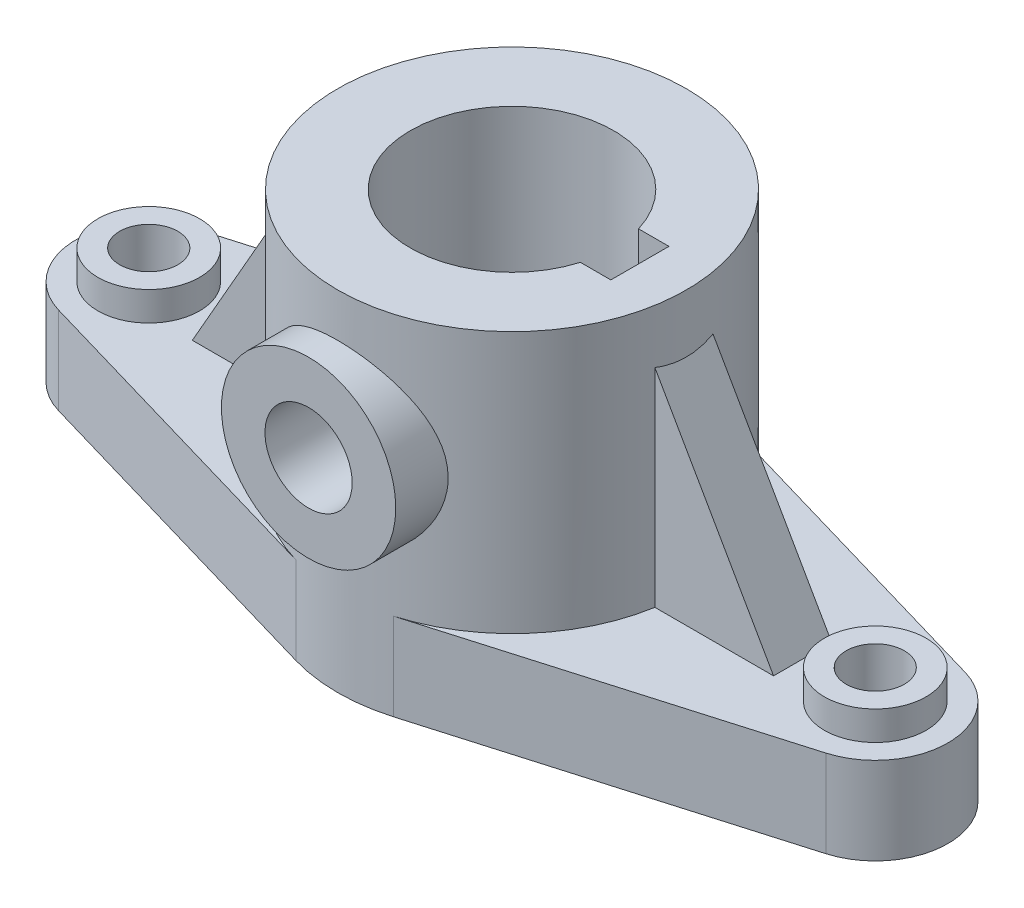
ISO-10303-21;
HEADER;
FILE_DESCRIPTION(('STEP AP214'),'2;1');
FILE_NAME('part.step','',(''),(''),'','','');
FILE_SCHEMA(('AUTOMOTIVE_DESIGN { 1 0 10303 214 1 1 1 1 }'));
ENDSEC;
DATA;
#1=APPLICATION_CONTEXT('core data for automotive mechanical design processes');
#2=APPLICATION_PROTOCOL_DEFINITION('international standard','automotive_design',2000,#1);
#3=PRODUCT_CONTEXT('',#1,'mechanical');
#4=PRODUCT('Part','Part','',(#3));
#5=PRODUCT_RELATED_PRODUCT_CATEGORY('part','',(#4));
#6=PRODUCT_DEFINITION_FORMATION('','',#4);
#7=PRODUCT_DEFINITION_CONTEXT('part definition',#1,'design');
#8=PRODUCT_DEFINITION('design','',#6,#7);
#9=PRODUCT_DEFINITION_SHAPE('','',#8);
#10=(LENGTH_UNIT() NAMED_UNIT(*) SI_UNIT(.MILLI.,.METRE.));
#11=(NAMED_UNIT(*) PLANE_ANGLE_UNIT() SI_UNIT($,.RADIAN.));
#12=(NAMED_UNIT(*) SI_UNIT($,.STERADIAN.) SOLID_ANGLE_UNIT());
#13=UNCERTAINTY_MEASURE_WITH_UNIT(LENGTH_MEASURE(1.E-05),#10,'distance_accuracy_value','');
#14=(GEOMETRIC_REPRESENTATION_CONTEXT(3) GLOBAL_UNCERTAINTY_ASSIGNED_CONTEXT((#13)) GLOBAL_UNIT_ASSIGNED_CONTEXT((#10,
#11,#12)) REPRESENTATION_CONTEXT('',''));
#15=CARTESIAN_POINT('',(0.,0.,0.));
#16=DIRECTION('',(0.,0.,1.));
#17=DIRECTION('',(1.,0.,0.));
#18=AXIS2_PLACEMENT_3D('',#15,#16,#17);
#19=CARTESIAN_POINT('',(0.,6.,0.));
#20=DIRECTION('',(0.,1.,0.));
#21=DIRECTION('',(0.,0.,1.));
#22=AXIS2_PLACEMENT_3D('',#19,#20,#21);
#23=PLANE('',#22);
#24=CARTESIAN_POINT('',(-25.,6.,0.));
#25=DIRECTION('',(0.,1.,0.));
#26=DIRECTION('',(0.,0.,1.));
#27=AXIS2_PLACEMENT_3D('',#24,#25,#26);
#28=CIRCLE('',#27,3.5);
#29=CARTESIAN_POINT('',(-25.,6.,3.5));
#30=VERTEX_POINT('',#29);
#31=EDGE_CURVE('E285',#30,#30,#28,.T.);
#32=ORIENTED_EDGE('',*,*,#31,.F.);
#33=EDGE_LOOP('',(#32));
#34=FACE_BOUND('',#33,.T.);
#35=CARTESIAN_POINT('',(-25.,6.,0.));
#36=DIRECTION('',(0.,1.,0.));
#37=DIRECTION('',(0.,0.,-1.));
#38=AXIS2_PLACEMENT_3D('',#35,#36,#37);
#39=CIRCLE('',#38,5.00000000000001);
#40=CARTESIAN_POINT('',(-26.4,6.,-4.80000000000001));
#41=VERTEX_POINT('',#40);
#42=CARTESIAN_POINT('',(-26.4,6.,4.80000000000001));
#43=VERTEX_POINT('',#42);
#44=EDGE_CURVE('E311',#41,#43,#39,.T.);
#45=ORIENTED_EDGE('',*,*,#44,.T.);
#46=DIRECTION('',(0.96,0.,0.28));
#47=VECTOR('',#46,1.);
#48=CARTESIAN_POINT('',(-3.36,6.,11.52));
#49=LINE('',#48,#47);
#50=CARTESIAN_POINT('',(-3.36000000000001,6.,11.52));
#51=VERTEX_POINT('',#50);
#52=EDGE_CURVE('E314',#43,#51,#49,.T.);
#53=ORIENTED_EDGE('',*,*,#52,.T.);
#54=CARTESIAN_POINT('',(0.,6.,0.));
#55=DIRECTION('',(0.,1.,0.));
#56=DIRECTION('',(0.,0.,1.));
#57=AXIS2_PLACEMENT_3D('',#54,#55,#56);
#58=CIRCLE('',#57,12.);
#59=CARTESIAN_POINT('',(-11.8321595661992,6.,2.));
#60=VERTEX_POINT('',#59);
#61=EDGE_CURVE('E274',#60,#51,#58,.T.);
#62=ORIENTED_EDGE('',*,*,#61,.F.);
#63=DIRECTION('',(1.,0.,0.));
#64=VECTOR('',#63,1.);
#65=CARTESIAN_POINT('',(0.,6.,2.));
#66=LINE('',#65,#64);
#67=CARTESIAN_POINT('',(-20.,6.,2.));
#68=VERTEX_POINT('',#67);
#69=EDGE_CURVE('E196',#68,#60,#66,.T.);
#70=ORIENTED_EDGE('',*,*,#69,.F.);
#71=DIRECTION('',(0.,0.,1.));
#72=VECTOR('',#71,1.);
#73=CARTESIAN_POINT('',(-20.,6.,0.));
#74=LINE('',#73,#72);
#75=CARTESIAN_POINT('',(-20.,6.,-2.));
#76=VERTEX_POINT('',#75);
#77=EDGE_CURVE('E207',#76,#68,#74,.T.);
#78=ORIENTED_EDGE('',*,*,#77,.F.);
#79=DIRECTION('',(1.,0.,0.));
#80=VECTOR('',#79,1.);
#81=CARTESIAN_POINT('',(0.,6.,-2.));
#82=LINE('',#81,#80);
#83=CARTESIAN_POINT('',(-11.8321595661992,6.,-2.));
#84=VERTEX_POINT('',#83);
#85=EDGE_CURVE('E202',#76,#84,#82,.T.);
#86=ORIENTED_EDGE('',*,*,#85,.T.);
#87=CARTESIAN_POINT('',(-3.36,6.,-11.52));
#88=VERTEX_POINT('',#87);
#89=EDGE_CURVE('E282',#88,#84,#58,.T.);
#90=ORIENTED_EDGE('',*,*,#89,.F.);
#91=DIRECTION('',(-0.96,0.,0.28));
#92=VECTOR('',#91,1.);
#93=CARTESIAN_POINT('',(-3.36,6.,-11.52));
#94=LINE('',#93,#92);
#95=EDGE_CURVE('E309',#88,#41,#94,.T.);
#96=ORIENTED_EDGE('',*,*,#95,.T.);
#97=EDGE_LOOP('',(#45,#53,#62,#70,#78,#86,#90,#96));
#98=FACE_BOUND('',#97,.T.);
#99=ADVANCED_FACE('F37',(#34,#98),#23,.T.);
#100=DIRECTION('',(1.,0.,0.));
#101=VECTOR('',#100,1.);
#102=CARTESIAN_POINT('',(0.,6.,2.));
#103=LINE('',#102,#101);
#104=CARTESIAN_POINT('',(11.8321595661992,6.,2.));
#105=VERTEX_POINT('',#104);
#106=CARTESIAN_POINT('',(20.,6.,2.));
#107=VERTEX_POINT('',#106);
#108=EDGE_CURVE('E177',#105,#107,#103,.T.);
#109=ORIENTED_EDGE('',*,*,#108,.F.);
#110=CARTESIAN_POINT('',(3.36,6.,11.52));
#111=VERTEX_POINT('',#110);
#112=EDGE_CURVE('E279',#111,#105,#58,.T.);
#113=ORIENTED_EDGE('',*,*,#112,.F.);
#114=DIRECTION('',(0.96,0.,-0.28));
#115=VECTOR('',#114,1.);
#116=CARTESIAN_POINT('',(3.36,6.,11.52));
#117=LINE('',#116,#115);
#118=CARTESIAN_POINT('',(26.4,6.,4.80000000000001));
#119=VERTEX_POINT('',#118);
#120=EDGE_CURVE('E317',#111,#119,#117,.T.);
#121=ORIENTED_EDGE('',*,*,#120,.T.);
#122=CARTESIAN_POINT('',(25.,6.,0.));
#123=DIRECTION('',(0.,1.,0.));
#124=DIRECTION('',(0.,0.,1.));
#125=AXIS2_PLACEMENT_3D('',#122,#123,#124);
#126=CIRCLE('',#125,5.00000000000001);
#127=CARTESIAN_POINT('',(26.4,6.,-4.80000000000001));
#128=VERTEX_POINT('',#127);
#129=EDGE_CURVE('E319',#119,#128,#126,.T.);
#130=ORIENTED_EDGE('',*,*,#129,.T.);
#131=DIRECTION('',(-0.96,0.,-0.28));
#132=VECTOR('',#131,1.);
#133=CARTESIAN_POINT('',(3.36,6.,-11.52));
#134=LINE('',#133,#132);
#135=CARTESIAN_POINT('',(3.36,6.,-11.52));
#136=VERTEX_POINT('',#135);
#137=EDGE_CURVE('E321',#128,#136,#134,.T.);
#138=ORIENTED_EDGE('',*,*,#137,.T.);
#139=CARTESIAN_POINT('',(11.8321595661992,6.,-2.));
#140=VERTEX_POINT('',#139);
#141=EDGE_CURVE('E281',#140,#136,#58,.T.);
#142=ORIENTED_EDGE('',*,*,#141,.F.);
#143=DIRECTION('',(1.,0.,0.));
#144=VECTOR('',#143,1.);
#145=CARTESIAN_POINT('',(0.,6.,-2.));
#146=LINE('',#145,#144);
#147=CARTESIAN_POINT('',(20.,6.,-2.));
#148=VERTEX_POINT('',#147);
#149=EDGE_CURVE('E57',#140,#148,#146,.T.);
#150=ORIENTED_EDGE('',*,*,#149,.T.);
#151=DIRECTION('',(0.,0.,1.));
#152=VECTOR('',#151,1.);
#153=CARTESIAN_POINT('',(20.,6.,0.));
#154=LINE('',#153,#152);
#155=EDGE_CURVE('E52',#107,#148,#154,.F.);
#156=ORIENTED_EDGE('',*,*,#155,.F.);
#157=EDGE_LOOP('',(#109,#113,#121,#130,#138,#142,#150,#156));
#158=FACE_BOUND('',#157,.T.);
#159=CARTESIAN_POINT('',(25.,6.,0.));
#160=DIRECTION('',(0.,1.,0.));
#161=DIRECTION('',(0.,0.,1.));
#162=AXIS2_PLACEMENT_3D('',#159,#160,#161);
#163=CIRCLE('',#162,3.5);
#164=CARTESIAN_POINT('',(25.,6.,3.5));
#165=VERTEX_POINT('',#164);
#166=EDGE_CURVE('E294',#165,#165,#163,.T.);
#167=ORIENTED_EDGE('',*,*,#166,.F.);
#168=EDGE_LOOP('',(#167));
#169=FACE_BOUND('',#168,.T.);
#170=ADVANCED_FACE('F394',(#158,#169),#23,.T.);
#171=CARTESIAN_POINT('',(0.,0.,0.));
#172=DIRECTION('',(0.,1.,0.));
#173=DIRECTION('',(0.,0.,1.));
#174=AXIS2_PLACEMENT_3D('',#171,#172,#173);
#175=PLANE('',#174);
#176=CARTESIAN_POINT('',(25.,0.,0.));
#177=DIRECTION('',(0.,1.,0.));
#178=DIRECTION('',(0.,0.,1.));
#179=AXIS2_PLACEMENT_3D('',#176,#177,#178);
#180=CIRCLE('',#179,2.);
#181=CARTESIAN_POINT('',(25.,0.,2.));
#182=VERTEX_POINT('',#181);
#183=EDGE_CURVE('E305',#182,#182,#180,.T.);
#184=ORIENTED_EDGE('',*,*,#183,.T.);
#185=EDGE_LOOP('',(#184));
#186=FACE_BOUND('',#185,.T.);
#187=CARTESIAN_POINT('',(-25.,0.,0.));
#188=DIRECTION('',(0.,1.,0.));
#189=DIRECTION('',(0.,0.,-1.));
#190=AXIS2_PLACEMENT_3D('',#187,#188,#189);
#191=CIRCLE('',#190,2.);
#192=CARTESIAN_POINT('',(-25.,0.,-2.));
#193=VERTEX_POINT('',#192);
#194=EDGE_CURVE('E302',#193,#193,#191,.T.);
#195=ORIENTED_EDGE('',*,*,#194,.T.);
#196=EDGE_LOOP('',(#195));
#197=FACE_BOUND('',#196,.T.);
#198=CARTESIAN_POINT('',(0.,0.,0.));
#199=DIRECTION('',(0.,1.,0.));
#200=DIRECTION('',(0.,0.,1.));
#201=AXIS2_PLACEMENT_3D('',#198,#199,#200);
#202=CIRCLE('',#201,7.);
#203=CARTESIAN_POINT('',(6.70820393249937,0.,-2.));
#204=VERTEX_POINT('',#203);
#205=CARTESIAN_POINT('',(6.70820393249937,0.,2.));
#206=VERTEX_POINT('',#205);
#207=EDGE_CURVE('E298',#204,#206,#202,.T.);
#208=ORIENTED_EDGE('',*,*,#207,.T.);
#209=DIRECTION('',(1.,0.,0.));
#210=VECTOR('',#209,1.);
#211=CARTESIAN_POINT('',(8.80227592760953,0.,2.));
#212=LINE('',#211,#210);
#213=CARTESIAN_POINT('',(8.80227592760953,0.,2.));
#214=VERTEX_POINT('',#213);
#215=EDGE_CURVE('E245',#206,#214,#212,.T.);
#216=ORIENTED_EDGE('',*,*,#215,.T.);
#217=DIRECTION('',(0.,0.,-1.));
#218=VECTOR('',#217,1.);
#219=CARTESIAN_POINT('',(8.80227592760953,0.,-2.));
#220=LINE('',#219,#218);
#221=CARTESIAN_POINT('',(8.80227592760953,0.,-2.));
#222=VERTEX_POINT('',#221);
#223=EDGE_CURVE('E248',#214,#222,#220,.T.);
#224=ORIENTED_EDGE('',*,*,#223,.T.);
#225=DIRECTION('',(-1.,0.,0.));
#226=VECTOR('',#225,1.);
#227=CARTESIAN_POINT('',(6.70820393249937,0.,-2.));
#228=LINE('',#227,#226);
#229=EDGE_CURVE('E252',#222,#204,#228,.T.);
#230=ORIENTED_EDGE('',*,*,#229,.T.);
#231=EDGE_LOOP('',(#208,#216,#224,#230));
#232=FACE_BOUND('',#231,.T.);
#233=DIRECTION('',(0.96,0.,0.28));
#234=VECTOR('',#233,1.);
#235=CARTESIAN_POINT('',(-3.36,0.,11.52));
#236=LINE('',#235,#234);
#237=CARTESIAN_POINT('',(-26.4,0.,4.80000000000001));
#238=VERTEX_POINT('',#237);
#239=CARTESIAN_POINT('',(-3.36000000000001,0.,11.52));
#240=VERTEX_POINT('',#239);
#241=EDGE_CURVE('E331',#238,#240,#236,.T.);
#242=ORIENTED_EDGE('',*,*,#241,.F.);
#243=CARTESIAN_POINT('',(-25.,0.,0.));
#244=DIRECTION('',(0.,1.,0.));
#245=DIRECTION('',(0.,0.,-1.));
#246=AXIS2_PLACEMENT_3D('',#243,#244,#245);
#247=CIRCLE('',#246,5.00000000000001);
#248=CARTESIAN_POINT('',(-26.4,0.,-4.80000000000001));
#249=VERTEX_POINT('',#248);
#250=EDGE_CURVE('E329',#249,#238,#247,.T.);
#251=ORIENTED_EDGE('',*,*,#250,.F.);
#252=DIRECTION('',(-0.96,0.,0.28));
#253=VECTOR('',#252,1.);
#254=CARTESIAN_POINT('',(-3.36,0.,-11.52));
#255=LINE('',#254,#253);
#256=CARTESIAN_POINT('',(-3.36,0.,-11.52));
#257=VERTEX_POINT('',#256);
#258=EDGE_CURVE('E327',#257,#249,#255,.T.);
#259=ORIENTED_EDGE('',*,*,#258,.F.);
#260=CARTESIAN_POINT('',(0.,0.,0.));
#261=DIRECTION('',(0.,1.,0.));
#262=DIRECTION('',(0.,0.,1.));
#263=AXIS2_PLACEMENT_3D('',#260,#261,#262);
#264=CIRCLE('',#263,12.);
#265=CARTESIAN_POINT('',(3.36,0.,-11.52));
#266=VERTEX_POINT('',#265);
#267=EDGE_CURVE('E308',#266,#257,#264,.T.);
#268=ORIENTED_EDGE('',*,*,#267,.F.);
#269=DIRECTION('',(-0.96,0.,-0.28));
#270=VECTOR('',#269,1.);
#271=CARTESIAN_POINT('',(3.36,0.,-11.52));
#272=LINE('',#271,#270);
#273=CARTESIAN_POINT('',(26.4,0.,-4.80000000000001));
#274=VERTEX_POINT('',#273);
#275=EDGE_CURVE('E312',#274,#266,#272,.T.);
#276=ORIENTED_EDGE('',*,*,#275,.F.);
#277=CARTESIAN_POINT('',(25.,0.,0.));
#278=DIRECTION('',(0.,1.,0.));
#279=DIRECTION('',(0.,0.,1.));
#280=AXIS2_PLACEMENT_3D('',#277,#278,#279);
#281=CIRCLE('',#280,5.00000000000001);
#282=CARTESIAN_POINT('',(26.4,0.,4.80000000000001));
#283=VERTEX_POINT('',#282);
#284=EDGE_CURVE('E337',#283,#274,#281,.T.);
#285=ORIENTED_EDGE('',*,*,#284,.F.);
#286=DIRECTION('',(0.96,0.,-0.28));
#287=VECTOR('',#286,1.);
#288=CARTESIAN_POINT('',(3.36,0.,11.52));
#289=LINE('',#288,#287);
#290=CARTESIAN_POINT('',(3.36,0.,11.52));
#291=VERTEX_POINT('',#290);
#292=EDGE_CURVE('E335',#291,#283,#289,.T.);
#293=ORIENTED_EDGE('',*,*,#292,.F.);
#294=CARTESIAN_POINT('',(0.,0.,0.));
#295=DIRECTION('',(0.,1.,0.));
#296=DIRECTION('',(0.,0.,1.));
#297=AXIS2_PLACEMENT_3D('',#294,#295,#296);
#298=CIRCLE('',#297,12.);
#299=EDGE_CURVE('E333',#240,#291,#298,.T.);
#300=ORIENTED_EDGE('',*,*,#299,.F.);
#301=EDGE_LOOP('',(#242,#251,#259,#268,#276,#285,#293,#300));
#302=FACE_BOUND('',#301,.T.);
#303=ADVANCED_FACE('F367',(#186,#197,#232,#302),#175,.F.);
#304=CARTESIAN_POINT('',(-3.36,6.,-11.52));
#305=DIRECTION('',(0.28,0.,0.96));
#306=DIRECTION('',(0.96,0.,-0.28));
#307=AXIS2_PLACEMENT_3D('',#304,#305,#306);
#308=PLANE('',#307);
#309=ORIENTED_EDGE('',*,*,#258,.T.);
#310=DIRECTION('',(0.,-1.,0.));
#311=VECTOR('',#310,1.);
#312=CARTESIAN_POINT('',(-26.4,6.,-4.80000000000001));
#313=LINE('',#312,#311);
#314=EDGE_CURVE('E45',#41,#249,#313,.T.);
#315=ORIENTED_EDGE('',*,*,#314,.F.);
#316=ORIENTED_EDGE('',*,*,#95,.F.);
#317=DIRECTION('',(0.,-1.,0.));
#318=VECTOR('',#317,1.);
#319=CARTESIAN_POINT('',(-3.36,6.,-11.52));
#320=LINE('',#319,#318);
#321=EDGE_CURVE('E12',#88,#257,#320,.T.);
#322=ORIENTED_EDGE('',*,*,#321,.T.);
#323=EDGE_LOOP('',(#309,#315,#316,#322));
#324=FACE_BOUND('',#323,.T.);
#325=ADVANCED_FACE('F39',(#324),#308,.F.);
#326=CARTESIAN_POINT('',(-25.,6.,0.));
#327=DIRECTION('',(0.,-1.,0.));
#328=DIRECTION('',(0.,0.,-1.));
#329=AXIS2_PLACEMENT_3D('',#326,#327,#328);
#330=CYLINDRICAL_SURFACE('',#329,5.00000000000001);
#331=DIRECTION('',(0.,-1.,0.));
#332=VECTOR('',#331,1.);
#333=CARTESIAN_POINT('',(-26.4,6.,4.80000000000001));
#334=LINE('',#333,#332);
#335=EDGE_CURVE('E354',#43,#238,#334,.T.);
#336=ORIENTED_EDGE('',*,*,#335,.F.);
#337=ORIENTED_EDGE('',*,*,#44,.F.);
#338=ORIENTED_EDGE('',*,*,#314,.T.);
#339=ORIENTED_EDGE('',*,*,#250,.T.);
#340=EDGE_LOOP('',(#336,#337,#338,#339));
#341=FACE_BOUND('',#340,.T.);
#342=ADVANCED_FACE('F362',(#341),#330,.T.);
#343=CARTESIAN_POINT('',(-3.36,6.,11.52));
#344=DIRECTION('',(0.28,0.,-0.96));
#345=DIRECTION('',(-0.96,0.,-0.28));
#346=AXIS2_PLACEMENT_3D('',#343,#344,#345);
#347=PLANE('',#346);
#348=ORIENTED_EDGE('',*,*,#241,.T.);
#349=DIRECTION('',(0.,-1.,0.));
#350=VECTOR('',#349,1.);
#351=CARTESIAN_POINT('',(-3.36000000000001,6.,11.52));
#352=LINE('',#351,#350);
#353=EDGE_CURVE('E351',#51,#240,#352,.T.);
#354=ORIENTED_EDGE('',*,*,#353,.F.);
#355=ORIENTED_EDGE('',*,*,#52,.F.);
#356=ORIENTED_EDGE('',*,*,#335,.T.);
#357=EDGE_LOOP('',(#348,#354,#355,#356));
#358=FACE_BOUND('',#357,.T.);
#359=ADVANCED_FACE('F373',(#358),#347,.F.);
#360=CARTESIAN_POINT('',(0.,6.,0.));
#361=DIRECTION('',(0.,-1.,0.));
#362=DIRECTION('',(0.,0.,-1.));
#363=AXIS2_PLACEMENT_3D('',#360,#361,#362);
#364=CYLINDRICAL_SURFACE('',#363,12.);
#365=CARTESIAN_POINT('',(0.,41.,0.));
#366=DIRECTION('',(-0.868243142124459,0.496138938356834,0.));
#367=DIRECTION('',(-0.496138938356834,-0.868243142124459,0.));
#368=AXIS2_PLACEMENT_3D('',#365,#366,#367);
#369=ELLIPSE('',#368,24.1867732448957,12.);
#370=CARTESIAN_POINT('',(-11.8321595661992,20.2937207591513,-2.));
#371=VERTEX_POINT('',#370);
#372=CARTESIAN_POINT('',(-11.8321595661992,20.2937207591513,2.));
#373=VERTEX_POINT('',#372);
#374=EDGE_CURVE('E205',#371,#373,#369,.T.);
#375=ORIENTED_EDGE('',*,*,#374,.T.);
#376=DIRECTION('',(0.,-1.,0.));
#377=VECTOR('',#376,1.);
#378=CARTESIAN_POINT('',(-11.8321595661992,6.,2.));
#379=LINE('',#378,#377);
#380=EDGE_CURVE('E192',#373,#60,#379,.T.);
#381=ORIENTED_EDGE('',*,*,#380,.T.);
#382=ORIENTED_EDGE('',*,*,#61,.T.);
#383=ORIENTED_EDGE('',*,*,#353,.T.);
#384=ORIENTED_EDGE('',*,*,#299,.T.);
#385=DIRECTION('',(0.,-1.,0.));
#386=VECTOR('',#385,1.);
#387=CARTESIAN_POINT('',(3.36,6.,11.52));
#388=LINE('',#387,#386);
#389=EDGE_CURVE('E348',#111,#291,#388,.T.);
#390=ORIENTED_EDGE('',*,*,#389,.F.);
#391=ORIENTED_EDGE('',*,*,#112,.T.);
#392=DIRECTION('',(0.,-1.,0.));
#393=VECTOR('',#392,1.);
#394=CARTESIAN_POINT('',(11.8321595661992,6.,2.));
#395=LINE('',#394,#393);
#396=CARTESIAN_POINT('',(11.8321595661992,20.2937207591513,2.));
#397=VERTEX_POINT('',#396);
#398=EDGE_CURVE('E167',#105,#397,#395,.F.);
#399=ORIENTED_EDGE('',*,*,#398,.T.);
#400=CARTESIAN_POINT('',(0.,41.,0.));
#401=DIRECTION('',(-0.868243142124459,-0.496138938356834,0.));
#402=DIRECTION('',(0.496138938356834,-0.868243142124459,0.));
#403=AXIS2_PLACEMENT_3D('',#400,#401,#402);
#404=ELLIPSE('',#403,24.1867732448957,12.);
#405=CARTESIAN_POINT('',(11.8321595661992,20.2937207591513,-2.));
#406=VERTEX_POINT('',#405);
#407=EDGE_CURVE('E160',#397,#406,#404,.F.);
#408=ORIENTED_EDGE('',*,*,#407,.T.);
#409=DIRECTION('',(0.,-1.,0.));
#410=VECTOR('',#409,1.);
#411=CARTESIAN_POINT('',(11.8321595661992,6.,-2.));
#412=LINE('',#411,#410);
#413=EDGE_CURVE('E164',#140,#406,#412,.F.);
#414=ORIENTED_EDGE('',*,*,#413,.F.);
#415=ORIENTED_EDGE('',*,*,#141,.T.);
#416=DIRECTION('',(0.,-1.,0.));
#417=VECTOR('',#416,1.);
#418=CARTESIAN_POINT('',(3.36,6.,-11.52));
#419=LINE('',#418,#417);
#420=EDGE_CURVE('E324',#136,#266,#419,.T.);
#421=ORIENTED_EDGE('',*,*,#420,.T.);
#422=ORIENTED_EDGE('',*,*,#267,.T.);
#423=ORIENTED_EDGE('',*,*,#321,.F.);
#424=ORIENTED_EDGE('',*,*,#89,.T.);
#425=DIRECTION('',(0.,-1.,0.));
#426=VECTOR('',#425,1.);
#427=CARTESIAN_POINT('',(-11.8321595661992,6.,-2.));
#428=LINE('',#427,#426);
#429=EDGE_CURVE('E199',#371,#84,#428,.T.);
#430=ORIENTED_EDGE('',*,*,#429,.F.);
#431=EDGE_LOOP('',(#375,#381,#382,#383,#384,#390,#391,#399,#408,#414,#415,#421,#422,#423,#424,#430));
#432=FACE_BOUND('',#431,.T.);
#433=CARTESIAN_POINT('',(0.,24.,0.));
#434=DIRECTION('',(0.,1.,0.));
#435=DIRECTION('',(0.,0.,1.));
#436=AXIS2_PLACEMENT_3D('',#433,#434,#435);
#437=CIRCLE('',#436,12.);
#438=CARTESIAN_POINT('',(0.,24.,12.));
#439=VERTEX_POINT('',#438);
#440=EDGE_CURVE('E275',#439,#439,#437,.T.);
#441=ORIENTED_EDGE('',*,*,#440,.F.);
#442=EDGE_LOOP('',(#441));
#443=FACE_BOUND('',#442,.T.);
#444=CARTESIAN_POINT('',(6.,15.,10.3923048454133));
#445=CARTESIAN_POINT('',(5.99999932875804,15.1563978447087,10.392305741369));
#446=CARTESIAN_POINT('',(5.99387675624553,15.3128093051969,10.39584745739));
#447=CARTESIAN_POINT('',(5.96946677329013,15.6244268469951,10.4098828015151));
#448=CARTESIAN_POINT('',(5.95117369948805,15.7796323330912,10.4203796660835));
#449=CARTESIAN_POINT('',(5.90262923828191,16.0878140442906,10.447954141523));
#450=CARTESIAN_POINT('',(5.8723590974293,16.2407863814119,10.4650420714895));
#451=CARTESIAN_POINT('',(5.80022662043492,16.5432291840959,10.5051926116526));
#452=CARTESIAN_POINT('',(5.75835924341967,16.6926980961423,10.5282578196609));
#453=CARTESIAN_POINT('',(5.663772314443,16.9862843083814,10.5794400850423));
#454=CARTESIAN_POINT('',(5.61111714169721,17.1304276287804,10.607527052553));
#455=CARTESIAN_POINT('',(5.49530086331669,17.4135220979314,10.6679865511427));
#456=CARTESIAN_POINT('',(5.43213569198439,17.552471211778,10.7003607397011));
#457=CARTESIAN_POINT('',(5.22766532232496,17.9603891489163,10.802532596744));
#458=CARTESIAN_POINT('',(5.07129480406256,18.2207063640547,10.8774308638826));
#459=CARTESIAN_POINT('',(4.70799231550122,18.7338743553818,11.0398177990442));
#460=CARTESIAN_POINT('',(4.49795386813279,18.9843384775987,11.1278353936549));
#461=CARTESIAN_POINT('',(4.03948117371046,19.4484666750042,11.3023273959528));
#462=CARTESIAN_POINT('',(3.79102789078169,19.6621123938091,11.3888010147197));
#463=CARTESIAN_POINT('',(3.38439787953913,19.9574733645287,11.5138135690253));
#464=CARTESIAN_POINT('',(3.23805814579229,20.0542962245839,11.5559227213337));
#465=CARTESIAN_POINT('',(2.93666573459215,20.235153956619,11.6361618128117));
#466=CARTESIAN_POINT('',(2.78161655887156,20.3191939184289,11.6742933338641));
#467=CARTESIAN_POINT('',(2.46380865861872,20.4736515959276,11.7454742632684));
#468=CARTESIAN_POINT('',(2.30105193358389,20.5440728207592,11.7785249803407));
#469=CARTESIAN_POINT('',(1.96895637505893,20.6705171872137,11.838566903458));
#470=CARTESIAN_POINT('',(1.79961824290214,20.7265418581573,11.8655587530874));
#471=CARTESIAN_POINT('',(1.46796523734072,20.8200186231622,11.910964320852));
#472=CARTESIAN_POINT('',(1.30600725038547,20.8585081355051,11.9298515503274));
#473=CARTESIAN_POINT('',(0.978851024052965,20.9219597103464,11.9611388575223));
#474=CARTESIAN_POINT('',(0.813653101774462,20.9469230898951,11.9735395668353));
#475=CARTESIAN_POINT('',(0.481460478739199,20.9829839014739,11.9914908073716));
#476=CARTESIAN_POINT('',(0.314466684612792,20.9940880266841,11.9970446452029));
#477=CARTESIAN_POINT('',(-0.0199464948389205,21.0022971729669,12.0011481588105));
#478=CARTESIAN_POINT('',(-0.187365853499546,20.9994030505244,11.9996982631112));
#479=CARTESIAN_POINT('',(-0.506589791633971,20.9805233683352,11.9902712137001));
#480=CARTESIAN_POINT('',(-0.658482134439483,20.9657022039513,11.9828746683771));
#481=CARTESIAN_POINT('',(-0.960375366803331,20.9246005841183,11.9624651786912));
#482=CARTESIAN_POINT('',(-1.11037564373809,20.8983165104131,11.9494504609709));
#483=CARTESIAN_POINT('',(-1.40736231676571,20.834585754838,11.9181215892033));
#484=CARTESIAN_POINT('',(-1.554349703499,20.7971428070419,11.8998092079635));
#485=CARTESIAN_POINT('',(-1.84448858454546,20.7114582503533,11.8583030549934));
#486=CARTESIAN_POINT('',(-1.98763858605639,20.6632125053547,11.8351074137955));
#487=CARTESIAN_POINT('',(-2.27111450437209,20.5556566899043,11.7840167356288));
#488=CARTESIAN_POINT('',(-2.41137687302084,20.4962070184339,11.7560628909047));
#489=CARTESIAN_POINT('',(-2.68633468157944,20.3671873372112,11.6963002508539));
#490=CARTESIAN_POINT('',(-2.82102808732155,20.2976136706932,11.66449006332));
#491=CARTESIAN_POINT('',(-3.215717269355,20.0744838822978,11.5642835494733));
#492=CARTESIAN_POINT('',(-3.4664938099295,19.9064532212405,11.491079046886));
#493=CARTESIAN_POINT('',(-3.96107927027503,19.518619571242,11.3306592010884));
#494=CARTESIAN_POINT('',(-4.20198876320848,19.2954241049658,11.2427735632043));
#495=CARTESIAN_POINT('',(-4.64464192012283,18.8124193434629,11.0672494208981));
#496=CARTESIAN_POINT('',(-4.84635545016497,18.5525821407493,10.9796111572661));
#497=CARTESIAN_POINT('',(-5.12154774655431,18.1305648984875,10.852690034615));
#498=CARTESIAN_POINT('',(-5.21088428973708,17.9795341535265,10.809958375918));
#499=CARTESIAN_POINT('',(-5.37636197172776,17.6693787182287,10.7286167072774));
#500=CARTESIAN_POINT('',(-5.45250906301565,17.5102577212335,10.6900048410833));
#501=CARTESIAN_POINT('',(-5.5908133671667,17.184955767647,10.6183275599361));
#502=CARTESIAN_POINT('',(-5.65297884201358,17.0187790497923,10.5852588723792));
#503=CARTESIAN_POINT('',(-5.76261014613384,16.6804543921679,10.5259781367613));
#504=CARTESIAN_POINT('',(-5.81007797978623,16.5083072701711,10.4997651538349));
#505=CARTESIAN_POINT('',(-5.8864684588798,16.1732970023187,10.4571147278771));
#506=CARTESIAN_POINT('',(-5.91656209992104,16.0107783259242,10.440067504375));
#507=CARTESIAN_POINT('',(-5.96327046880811,15.683204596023,10.413459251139));
#508=CARTESIAN_POINT('',(-5.9798859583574,15.5181496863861,10.4038977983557));
#509=CARTESIAN_POINT('',(-5.99937433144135,15.1870615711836,10.3926721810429));
#510=CARTESIAN_POINT('',(-6.00225551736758,15.0210290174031,10.3910032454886));
#511=CARTESIAN_POINT('',(-5.9942505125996,14.6894142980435,10.3956232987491));
#512=CARTESIAN_POINT('',(-5.98336525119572,14.5238321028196,10.4019117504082));
#513=CARTESIAN_POINT('',(-5.94994827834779,14.212698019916,10.4210572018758));
#514=CARTESIAN_POINT('',(-5.92882610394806,14.0669425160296,10.4331174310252));
#515=CARTESIAN_POINT('',(-5.8760573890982,13.777894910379,10.462928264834));
#516=CARTESIAN_POINT('',(-5.84440736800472,13.6346036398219,10.4806807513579));
#517=CARTESIAN_POINT('',(-5.77092581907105,13.3514230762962,10.5213199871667));
#518=CARTESIAN_POINT('',(-5.72909561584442,13.2115333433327,10.544206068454));
#519=CARTESIAN_POINT('',(-5.63565081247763,12.9358651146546,10.5944442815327));
#520=CARTESIAN_POINT('',(-5.58403239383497,12.8000882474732,10.6217981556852));
#521=CARTESIAN_POINT('',(-5.40993804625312,12.3876925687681,10.7121521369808));
#522=CARTESIAN_POINT('',(-5.27158161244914,12.1189705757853,10.7814923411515));
#523=CARTESIAN_POINT('',(-4.95770514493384,11.6071396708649,10.9293734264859));
#524=CARTESIAN_POINT('',(-4.78216602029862,11.3640440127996,11.0079190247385));
#525=CARTESIAN_POINT('',(-4.37304147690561,10.8781478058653,11.1772756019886));
#526=CARTESIAN_POINT('',(-4.13492832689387,10.6392472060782,11.2683846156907));
#527=CARTESIAN_POINT('',(-3.62037026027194,10.2034964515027,11.4440644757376));
#528=CARTESIAN_POINT('',(-3.3439124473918,10.0066605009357,11.5286331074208));
#529=CARTESIAN_POINT('',(-2.90128902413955,9.74518907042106,11.6450329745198));
#530=CARTESIAN_POINT('',(-2.74684527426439,9.6628055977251,11.6825150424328));
#531=CARTESIAN_POINT('',(-2.43042899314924,9.51149206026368,11.7524125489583));
#532=CARTESIAN_POINT('',(-2.26845983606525,9.44255603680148,11.7848302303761));
#533=CARTESIAN_POINT('',(-1.9382010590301,9.31893854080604,11.8436272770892));
#534=CARTESIAN_POINT('',(-1.76991449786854,9.26425026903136,11.8700095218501));
#535=CARTESIAN_POINT('',(-1.42829668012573,9.16978910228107,11.9159410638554));
#536=CARTESIAN_POINT('',(-1.2549660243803,9.13001443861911,11.9354911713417));
#537=CARTESIAN_POINT('',(-0.920881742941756,9.0688859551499,11.9656791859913));
#538=CARTESIAN_POINT('',(-0.760433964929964,9.04617645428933,11.9769704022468));
#539=CARTESIAN_POINT('',(-0.437909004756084,9.01380787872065,11.9930937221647));
#540=CARTESIAN_POINT('',(-0.27583194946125,9.00414779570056,11.9979263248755));
#541=CARTESIAN_POINT('',(0.048585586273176,8.99800410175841,12.0009977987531));
#542=CARTESIAN_POINT('',(0.210925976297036,9.00151665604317,11.9992385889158));
#543=CARTESIAN_POINT('',(0.534582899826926,9.02166337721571,11.9891797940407));
#544=CARTESIAN_POINT('',(0.695899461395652,9.03829718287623,11.980880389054));
#545=CARTESIAN_POINT('',(1.00560292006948,9.08294010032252,11.9587311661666));
#546=CARTESIAN_POINT('',(1.15413886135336,9.11012336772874,11.945285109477));
#547=CARTESIAN_POINT('',(1.44825211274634,9.17545982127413,11.9132052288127));
#548=CARTESIAN_POINT('',(1.59382846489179,9.21361650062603,11.894569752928));
#549=CARTESIAN_POINT('',(1.8810400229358,9.3005100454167,11.8525414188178));
#550=CARTESIAN_POINT('',(2.02267631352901,9.34924396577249,11.8291498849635));
#551=CARTESIAN_POINT('',(2.30127410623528,9.45685355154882,11.7781255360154));
#552=CARTESIAN_POINT('',(2.43823379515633,9.51573309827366,11.7504910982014));
#553=CARTESIAN_POINT('',(2.85237786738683,9.71230158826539,11.6595788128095));
#554=CARTESIAN_POINT('',(3.12070571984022,9.8662565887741,11.5901238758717));
#555=CARTESIAN_POINT('',(3.6286930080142,10.2117669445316,11.4412811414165));
#556=CARTESIAN_POINT('',(3.86833919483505,10.4033395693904,11.3618887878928));
#557=CARTESIAN_POINT('',(4.33746428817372,10.8407644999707,11.1917214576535));
#558=CARTESIAN_POINT('',(4.56355782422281,11.0901213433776,11.1006000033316));
#559=CARTESIAN_POINT('',(4.97200803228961,11.6247579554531,10.9237724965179));
#560=CARTESIAN_POINT('',(5.1543260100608,11.9100691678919,10.8380712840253));
#561=CARTESIAN_POINT('',(5.39331084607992,12.3650634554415,10.7200955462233));
#562=CARTESIAN_POINT('',(5.46810808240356,12.5239515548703,10.6820243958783));
#563=CARTESIAN_POINT('',(5.60382523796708,12.8487065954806,10.6114556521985));
#564=CARTESIAN_POINT('',(5.66475230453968,13.0145698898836,10.5789551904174));
#565=CARTESIAN_POINT('',(5.77185247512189,13.3516894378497,10.5209043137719));
#566=CARTESIAN_POINT('',(5.81806353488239,13.5229305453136,10.4953360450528));
#567=CARTESIAN_POINT('',(5.89524853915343,13.8697105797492,10.4521774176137));
#568=CARTESIAN_POINT('',(5.92623313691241,14.0452464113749,10.434581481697));
#569=CARTESIAN_POINT('',(5.96618770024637,14.3507974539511,10.4117704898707));
#570=CARTESIAN_POINT('',(5.97885517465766,14.4801890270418,10.4044886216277));
#571=CARTESIAN_POINT('',(5.99576188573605,14.739717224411,10.3947552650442));
#572=CARTESIAN_POINT('',(6.00000055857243,14.8698538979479,10.3923040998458));
#573=CARTESIAN_POINT('',(6.,15.,10.3923048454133));
#574=B_SPLINE_CURVE_WITH_KNOTS('',3,(#444,#445,#446,#447,#448,#449,#450,#451,#452,#453,#454,
#455,#456,#457,#458,#459,#460,#461,#462,#463,#464,#465,#466,#467,#468,#469,#470,#471,#472,#473,
#474,#475,#476,#477,#478,#479,#480,#481,#482,#483,#484,#485,#486,#487,#488,#489,#490,#491,#492,
#493,#494,#495,#496,#497,#498,#499,#500,#501,#502,#503,#504,#505,#506,#507,#508,#509,#510,#511,
#512,#513,#514,#515,#516,#517,#518,#519,#520,#521,#522,#523,#524,#525,#526,#527,#528,#529,#530,
#531,#532,#533,#534,#535,#536,#537,#538,#539,#540,#541,#542,#543,#544,#545,#546,#547,#548,#549,
#550,#551,#552,#553,#554,#555,#556,#557,#558,#559,#560,#561,#562,#563,#564,#565,#566,#567,#568,
#569,#570,#571,#572,#573),.UNSPECIFIED.,.T.,.F.,(4,2,2,2,2,2,2,2,2,2,2,2,2,2,2,2,2,2,2,2,2,2,2,
2,2,2,2,2,2,2,2,2,2,2,2,2,2,2,2,2,2,2,2,2,2,2,2,2,2,2,2,2,2,2,2,2,2,2,2,2,2,2,2,2,4),(0.,
0.46905886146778,0.938336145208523,1.40835114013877,1.87857075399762,2.34606192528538,
2.81373436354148,3.74819914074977,4.75973666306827,5.77177705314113,6.31254530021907,
6.85309766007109,7.39351054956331,7.9338660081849,8.43579584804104,8.93767680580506,
9.43931529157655,9.94092308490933,10.3987605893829,10.8567427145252,11.3145717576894,
11.7725763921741,12.2367183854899,12.7010284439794,13.6290943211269,14.6448878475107,
15.6614592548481,16.2026787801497,16.7436534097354,17.2843075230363,17.8248878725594,
18.3226559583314,18.8203959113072,19.317834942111,19.8152403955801,20.2580476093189,
20.7010013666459,21.1438975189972,21.5869668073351,22.5132614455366,23.4400328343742,
24.4836282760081,25.5275755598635,26.0639955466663,26.6001772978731,27.1361027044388,
27.6719645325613,28.1586420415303,28.6452819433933,29.1317801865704,29.6182650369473,
30.072548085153,30.5269759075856,30.9812773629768,31.4357530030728,32.3826620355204,
33.3300067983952,34.3716315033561,35.4141735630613,35.9526248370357,36.4907980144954,
37.027571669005,37.5639692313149,37.9542693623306,38.3445956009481),.UNSPECIFIED.);
#575=CARTESIAN_POINT('',(6.,15.,10.3923048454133));
#576=VERTEX_POINT('',#575);
#577=EDGE_CURVE('E217',#576,#576,#574,.T.);
#578=ORIENTED_EDGE('',*,*,#577,.F.);
#579=EDGE_LOOP('',(#578));
#580=FACE_BOUND('',#579,.T.);
#581=ADVANCED_FACE('F162',(#432,#443,#580),#364,.T.);
#582=CARTESIAN_POINT('',(3.36,6.,11.52));
#583=DIRECTION('',(-0.28,0.,-0.96));
#584=DIRECTION('',(-0.96,0.,0.28));
#585=AXIS2_PLACEMENT_3D('',#582,#583,#584);
#586=PLANE('',#585);
#587=ORIENTED_EDGE('',*,*,#292,.T.);
#588=DIRECTION('',(0.,-1.,0.));
#589=VECTOR('',#588,1.);
#590=CARTESIAN_POINT('',(26.4,6.,4.80000000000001));
#591=LINE('',#590,#589);
#592=EDGE_CURVE('E345',#119,#283,#591,.T.);
#593=ORIENTED_EDGE('',*,*,#592,.F.);
#594=ORIENTED_EDGE('',*,*,#120,.F.);
#595=ORIENTED_EDGE('',*,*,#389,.T.);
#596=EDGE_LOOP('',(#587,#593,#594,#595));
#597=FACE_BOUND('',#596,.T.);
#598=ADVANCED_FACE('F392',(#597),#586,.F.);
#599=CARTESIAN_POINT('',(25.,6.,0.));
#600=DIRECTION('',(0.,-1.,0.));
#601=DIRECTION('',(0.,0.,-1.));
#602=AXIS2_PLACEMENT_3D('',#599,#600,#601);
#603=CYLINDRICAL_SURFACE('',#602,5.00000000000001);
#604=ORIENTED_EDGE('',*,*,#284,.T.);
#605=DIRECTION('',(0.,-1.,0.));
#606=VECTOR('',#605,1.);
#607=CARTESIAN_POINT('',(26.4,6.,-4.80000000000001));
#608=LINE('',#607,#606);
#609=EDGE_CURVE('E342',#128,#274,#608,.T.);
#610=ORIENTED_EDGE('',*,*,#609,.F.);
#611=ORIENTED_EDGE('',*,*,#129,.F.);
#612=ORIENTED_EDGE('',*,*,#592,.T.);
#613=EDGE_LOOP('',(#604,#610,#611,#612));
#614=FACE_BOUND('',#613,.T.);
#615=ADVANCED_FACE('F389',(#614),#603,.T.);
#616=CARTESIAN_POINT('',(3.36,6.,-11.52));
#617=DIRECTION('',(-0.28,0.,0.96));
#618=DIRECTION('',(0.96,0.,0.28));
#619=AXIS2_PLACEMENT_3D('',#616,#617,#618);
#620=PLANE('',#619);
#621=ORIENTED_EDGE('',*,*,#275,.T.);
#622=ORIENTED_EDGE('',*,*,#420,.F.);
#623=ORIENTED_EDGE('',*,*,#137,.F.);
#624=ORIENTED_EDGE('',*,*,#609,.T.);
#625=EDGE_LOOP('',(#621,#622,#623,#624));
#626=FACE_BOUND('',#625,.T.);
#627=ADVANCED_FACE('F384',(#626),#620,.F.);
#628=CARTESIAN_POINT('',(25.,6.,0.));
#629=DIRECTION('',(0.,-1.,0.));
#630=DIRECTION('',(0.,0.,-1.));
#631=AXIS2_PLACEMENT_3D('',#628,#629,#630);
#632=CYLINDRICAL_SURFACE('',#631,2.);
#633=ORIENTED_EDGE('',*,*,#183,.F.);
#634=EDGE_LOOP('',(#633));
#635=FACE_BOUND('',#634,.T.);
#636=CARTESIAN_POINT('',(25.,8.,0.));
#637=DIRECTION('',(0.,1.,0.));
#638=DIRECTION('',(0.,0.,1.));
#639=AXIS2_PLACEMENT_3D('',#636,#637,#638);
#640=CIRCLE('',#639,2.);
#641=CARTESIAN_POINT('',(25.,8.,2.));
#642=VERTEX_POINT('',#641);
#643=EDGE_CURVE('E289',#642,#642,#640,.T.);
#644=ORIENTED_EDGE('',*,*,#643,.T.);
#645=EDGE_LOOP('',(#644));
#646=FACE_BOUND('',#645,.T.);
#647=ADVANCED_FACE('F413',(#635,#646),#632,.F.);
#648=CARTESIAN_POINT('',(-25.,6.,0.));
#649=DIRECTION('',(0.,-1.,0.));
#650=DIRECTION('',(0.,0.,-1.));
#651=AXIS2_PLACEMENT_3D('',#648,#649,#650);
#652=CYLINDRICAL_SURFACE('',#651,2.);
#653=ORIENTED_EDGE('',*,*,#194,.F.);
#654=EDGE_LOOP('',(#653));
#655=FACE_BOUND('',#654,.T.);
#656=CARTESIAN_POINT('',(-25.,8.,0.));
#657=DIRECTION('',(0.,1.,0.));
#658=DIRECTION('',(0.,0.,1.));
#659=AXIS2_PLACEMENT_3D('',#656,#657,#658);
#660=CIRCLE('',#659,2.);
#661=CARTESIAN_POINT('',(-25.,8.,2.));
#662=VERTEX_POINT('',#661);
#663=EDGE_CURVE('E278',#662,#662,#660,.T.);
#664=ORIENTED_EDGE('',*,*,#663,.T.);
#665=EDGE_LOOP('',(#664));
#666=FACE_BOUND('',#665,.T.);
#667=ADVANCED_FACE('F603',(#655,#666),#652,.F.);
#668=CARTESIAN_POINT('',(0.,6.,0.));
#669=DIRECTION('',(0.,-1.,0.));
#670=DIRECTION('',(0.,0.,-1.));
#671=AXIS2_PLACEMENT_3D('',#668,#669,#670);
#672=CYLINDRICAL_SURFACE('',#671,7.);
#673=DIRECTION('',(0.,1.,0.));
#674=VECTOR('',#673,1.);
#675=CARTESIAN_POINT('',(6.70820393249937,0.,2.));
#676=LINE('',#675,#674);
#677=CARTESIAN_POINT('',(6.70820393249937,24.,2.));
#678=VERTEX_POINT('',#677);
#679=EDGE_CURVE('E255',#206,#678,#676,.T.);
#680=ORIENTED_EDGE('',*,*,#679,.F.);
#681=ORIENTED_EDGE('',*,*,#207,.F.);
#682=DIRECTION('',(0.,1.,0.));
#683=VECTOR('',#682,1.);
#684=CARTESIAN_POINT('',(6.70820393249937,0.,-2.));
#685=LINE('',#684,#683);
#686=CARTESIAN_POINT('',(6.70820393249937,24.,-2.));
#687=VERTEX_POINT('',#686);
#688=EDGE_CURVE('E263',#204,#687,#685,.T.);
#689=ORIENTED_EDGE('',*,*,#688,.T.);
#690=CARTESIAN_POINT('',(0.,24.,0.));
#691=DIRECTION('',(0.,1.,0.));
#692=DIRECTION('',(0.,0.,1.));
#693=AXIS2_PLACEMENT_3D('',#690,#691,#692);
#694=CIRCLE('',#693,7.);
#695=EDGE_CURVE('E266',#687,#678,#694,.T.);
#696=ORIENTED_EDGE('',*,*,#695,.T.);
#697=EDGE_LOOP('',(#680,#681,#689,#696));
#698=FACE_BOUND('',#697,.T.);
#699=CARTESIAN_POINT('',(3.,15.,6.32455532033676));
#700=CARTESIAN_POINT('',(2.99999904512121,14.9201992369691,6.32455623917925));
#701=CARTESIAN_POINT('',(2.99680914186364,14.8403691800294,6.32607259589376));
#702=CARTESIAN_POINT('',(2.98409481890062,14.6813131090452,6.33207844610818));
#703=CARTESIAN_POINT('',(2.97456636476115,14.6020875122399,6.33656983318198));
#704=CARTESIAN_POINT('',(2.93654933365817,14.3659109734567,6.35433138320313));
#705=CARTESIAN_POINT('',(2.8986294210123,14.2106800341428,6.3718883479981));
#706=CARTESIAN_POINT('',(2.79949691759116,13.9101296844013,6.41604959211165));
#707=CARTESIAN_POINT('',(2.73838302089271,13.7647713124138,6.44261548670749));
#708=CARTESIAN_POINT('',(2.59488993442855,13.4863744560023,6.50173461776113));
#709=CARTESIAN_POINT('',(2.51251491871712,13.3533335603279,6.53428667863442));
#710=CARTESIAN_POINT('',(2.32303426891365,13.0945471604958,6.604111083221));
#711=CARTESIAN_POINT('',(2.21474428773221,12.9697137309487,6.64154929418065));
#712=CARTESIAN_POINT('',(1.9789916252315,12.7392981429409,6.71556787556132));
#713=CARTESIAN_POINT('',(1.85152133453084,12.6337236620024,6.75214789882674));
#714=CARTESIAN_POINT('',(1.5737748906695,12.4400807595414,6.82236442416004));
#715=CARTESIAN_POINT('',(1.42271545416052,12.3530507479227,6.85578586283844));
#716=CARTESIAN_POINT('',(1.10640716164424,12.2060358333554,6.91387422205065));
#717=CARTESIAN_POINT('',(0.941164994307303,12.1460382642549,6.93854524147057));
#718=CARTESIAN_POINT('',(0.610764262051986,12.058134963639,6.97517471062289));
#719=CARTESIAN_POINT('',(0.446095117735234,12.0286539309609,6.98775448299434));
#720=CARTESIAN_POINT('',(0.113699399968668,11.9975173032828,7.00104925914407));
#721=CARTESIAN_POINT('',(-0.0540258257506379,11.995849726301,7.00176937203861));
#722=CARTESIAN_POINT('',(-0.376268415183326,12.0195902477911,6.99162033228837));
#723=CARTESIAN_POINT('',(-0.530941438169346,12.0432637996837,6.98149359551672));
#724=CARTESIAN_POINT('',(-0.833871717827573,12.1140240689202,6.95182205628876));
#725=CARTESIAN_POINT('',(-0.982128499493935,12.1611125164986,6.93227655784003));
#726=CARTESIAN_POINT('',(-1.27075797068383,12.2779065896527,6.88526693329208));
#727=CARTESIAN_POINT('',(-1.41097529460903,12.3479472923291,6.85768620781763));
#728=CARTESIAN_POINT('',(-1.67803533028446,12.5083173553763,6.79727675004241));
#729=CARTESIAN_POINT('',(-1.8048732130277,12.5986540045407,6.76444613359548));
#730=CARTESIAN_POINT('',(-2.05154784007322,12.804809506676,6.69393790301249));
#731=CARTESIAN_POINT('',(-2.1701729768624,12.922018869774,6.65608139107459));
#732=CARTESIAN_POINT('',(-2.38662617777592,13.1747028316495,6.58157631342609));
#733=CARTESIAN_POINT('',(-2.48444526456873,13.3101852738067,6.5449282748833));
#734=CARTESIAN_POINT('',(-2.65987942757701,13.6017798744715,6.47566835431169));
#735=CARTESIAN_POINT('',(-2.73662769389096,13.7584641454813,6.44325238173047));
#736=CARTESIAN_POINT('',(-2.86214771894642,14.0842890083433,6.3884939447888));
#737=CARTESIAN_POINT('',(-2.9109408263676,14.253419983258,6.36614379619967));
#738=CARTESIAN_POINT('',(-2.9759867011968,14.587172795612,6.33598550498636));
#739=CARTESIAN_POINT('',(-2.99421280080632,14.7513289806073,6.32729797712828));
#740=CARTESIAN_POINT('',(-3.00343131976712,15.0805489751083,6.32292988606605));
#741=CARTESIAN_POINT('',(-2.99443410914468,15.2456124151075,6.32724437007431));
#742=CARTESIAN_POINT('',(-2.9512647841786,15.5598625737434,6.34748143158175));
#743=CARTESIAN_POINT('',(-2.9188846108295,15.7093557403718,6.36257694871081));
#744=CARTESIAN_POINT('',(-2.83228012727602,16.0006454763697,6.40159573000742));
#745=CARTESIAN_POINT('',(-2.77805051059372,16.1424401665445,6.42552113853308));
#746=CARTESIAN_POINT('',(-2.64668378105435,16.4212098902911,6.48076667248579));
#747=CARTESIAN_POINT('',(-2.5686531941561,16.557707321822,6.51236308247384));
#748=CARTESIAN_POINT('',(-2.39277124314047,16.8163507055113,6.57901833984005));
#749=CARTESIAN_POINT('',(-2.29491096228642,16.9384901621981,6.61407874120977));
#750=CARTESIAN_POINT('',(-2.07211495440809,17.1760289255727,6.68739396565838));
#751=CARTESIAN_POINT('',(-1.94556360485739,17.2899152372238,6.72566111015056));
#752=CARTESIAN_POINT('',(-1.67428466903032,17.4951342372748,6.79826947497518));
#753=CARTESIAN_POINT('',(-1.5295552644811,17.5864646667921,6.83261030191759));
#754=CARTESIAN_POINT('',(-1.22458078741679,17.7440826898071,6.89381439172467));
#755=CARTESIAN_POINT('',(-1.06426298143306,17.8102450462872,6.92064008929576));
#756=CARTESIAN_POINT('',(-0.733319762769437,17.9141497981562,6.96347660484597));
#757=CARTESIAN_POINT('',(-0.562700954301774,17.9519101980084,6.9794942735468));
#758=CARTESIAN_POINT('',(-0.22948038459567,17.9955774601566,6.99808081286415));
#759=CARTESIAN_POINT('',(-0.0672060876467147,18.0036138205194,7.00154837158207));
#760=CARTESIAN_POINT('',(0.256339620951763,17.9934044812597,6.99717401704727));
#761=CARTESIAN_POINT('',(0.41761122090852,17.975163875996,6.98933429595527));
#762=CARTESIAN_POINT('',(0.728044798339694,17.9144464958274,6.96371224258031));
#763=CARTESIAN_POINT('',(0.877433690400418,17.8729461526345,6.9463310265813));
#764=CARTESIAN_POINT('',(1.16704890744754,17.7679838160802,6.90358200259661));
#765=CARTESIAN_POINT('',(1.30727354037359,17.7045177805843,6.87821272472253));
#766=CARTESIAN_POINT('',(1.58164154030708,17.554210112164,6.82048100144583));
#767=CARTESIAN_POINT('',(1.71521554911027,17.4664340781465,6.78785230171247));
#768=CARTESIAN_POINT('',(1.96631980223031,17.2713182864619,6.71941601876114));
#769=CARTESIAN_POINT('',(2.08384366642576,17.1639707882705,6.68360718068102));
#770=CARTESIAN_POINT('',(2.30839582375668,16.9236161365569,6.60956029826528));
#771=CARTESIAN_POINT('',(2.41404185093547,16.789311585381,6.57133471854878));
#772=CARTESIAN_POINT('',(2.60157161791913,16.5036538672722,6.49938146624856));
#773=CARTESIAN_POINT('',(2.68344152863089,16.3522908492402,6.46565641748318));
#774=CARTESIAN_POINT('',(2.78618250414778,16.1156175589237,6.42172587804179));
#775=CARTESIAN_POINT('',(2.81707998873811,16.035144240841,6.40819457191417));
#776=CARTESIAN_POINT('',(2.87192428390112,15.8714837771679,6.38380411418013));
#777=CARTESIAN_POINT('',(2.89587453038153,15.7882979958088,6.37294364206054));
#778=CARTESIAN_POINT('',(2.93649221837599,15.6200691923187,6.35433014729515));
#779=CARTESIAN_POINT('',(2.9531788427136,15.535031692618,6.3465689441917));
#780=CARTESIAN_POINT('',(2.97913893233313,15.3636372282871,6.33442493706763));
#781=CARTESIAN_POINT('',(2.98841807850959,15.2772813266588,6.33003954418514));
#782=CARTESIAN_POINT('',(2.99595579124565,15.1589385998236,6.32647229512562));
#783=CARTESIAN_POINT('',(2.99747183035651,15.1271757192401,6.32575401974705));
#784=CARTESIAN_POINT('',(2.99949413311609,15.0636101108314,6.3247953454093));
#785=CARTESIAN_POINT('',(3.00000038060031,15.0318073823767,6.32455495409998));
#786=CARTESIAN_POINT('',(3.,15.,6.32455532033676));
#787=B_SPLINE_CURVE_WITH_KNOTS('',3,(#699,#700,#701,#702,#703,#704,#705,#706,#707,#708,#709,
#710,#711,#712,#713,#714,#715,#716,#717,#718,#719,#720,#721,#722,#723,#724,#725,#726,#727,#728,
#729,#730,#731,#732,#733,#734,#735,#736,#737,#738,#739,#740,#741,#742,#743,#744,#745,#746,#747,
#748,#749,#750,#751,#752,#753,#754,#755,#756,#757,#758,#759,#760,#761,#762,#763,#764,#765,#766,
#767,#768,#769,#770,#771,#772,#773,#774,#775,#776,#777,#778,#779,#780,#781,#782,#783,#784,#785,
#786),.UNSPECIFIED.,.T.,.F.,(4,2,2,2,2,2,2,2,2,2,2,2,2,2,2,2,2,2,2,2,2,2,2,2,2,2,2,2,2,2,2,2,2,
2,2,2,2,2,2,2,2,2,2,4),(0.,0.239366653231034,0.478885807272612,0.958574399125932,
1.43624431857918,1.91382053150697,2.41995684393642,2.92629448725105,3.45610451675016,
3.98566604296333,4.48627308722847,4.98666446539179,5.45487182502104,5.92311378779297,
6.39852111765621,6.87409945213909,7.38485137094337,7.89582322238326,8.42542768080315,
8.95462715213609,9.44812252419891,9.94142993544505,10.4004743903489,10.8596303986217,
11.3387499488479,11.8180854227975,12.3391595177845,12.8602857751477,13.3839722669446,
13.9073265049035,14.3923682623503,14.8773159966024,15.3432850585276,15.8093399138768,
16.2966585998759,16.784170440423,17.3070906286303,17.8303143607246,18.0917878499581,
18.3531318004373,18.6137813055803,18.8742307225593,18.9696371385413,19.0650450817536),.UNSPECIFIED.);
#788=CARTESIAN_POINT('',(3.,15.,6.32455532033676));
#789=VERTEX_POINT('',#788);
#790=EDGE_CURVE('E210',#789,#789,#787,.T.);
#791=ORIENTED_EDGE('',*,*,#790,.F.);
#792=EDGE_LOOP('',(#791));
#793=FACE_BOUND('',#792,.T.);
#794=ADVANCED_FACE('F220',(#698,#793),#672,.F.);
#795=CARTESIAN_POINT('',(25.,8.,0.));
#796=DIRECTION('',(0.,1.,0.));
#797=DIRECTION('',(0.,0.,1.));
#798=AXIS2_PLACEMENT_3D('',#795,#796,#797);
#799=PLANE('',#798);
#800=ORIENTED_EDGE('',*,*,#643,.F.);
#801=EDGE_LOOP('',(#800));
#802=FACE_BOUND('',#801,.T.);
#803=CARTESIAN_POINT('',(25.,8.,0.));
#804=DIRECTION('',(0.,1.,0.));
#805=DIRECTION('',(0.,0.,1.));
#806=AXIS2_PLACEMENT_3D('',#803,#804,#805);
#807=CIRCLE('',#806,3.5);
#808=CARTESIAN_POINT('',(25.,8.,3.5));
#809=VERTEX_POINT('',#808);
#810=EDGE_CURVE('E295',#809,#809,#807,.T.);
#811=ORIENTED_EDGE('',*,*,#810,.T.);
#812=EDGE_LOOP('',(#811));
#813=FACE_BOUND('',#812,.T.);
#814=ADVANCED_FACE('F491',(#802,#813),#799,.T.);
#815=CARTESIAN_POINT('',(25.,8.,0.));
#816=DIRECTION('',(0.,-1.,0.));
#817=DIRECTION('',(0.,0.,-1.));
#818=AXIS2_PLACEMENT_3D('',#815,#816,#817);
#819=CYLINDRICAL_SURFACE('',#818,3.5);
#820=ORIENTED_EDGE('',*,*,#166,.T.);
#821=EDGE_LOOP('',(#820));
#822=FACE_BOUND('',#821,.T.);
#823=ORIENTED_EDGE('',*,*,#810,.F.);
#824=EDGE_LOOP('',(#823));
#825=FACE_BOUND('',#824,.T.);
#826=ADVANCED_FACE('F485',(#822,#825),#819,.T.);
#827=CARTESIAN_POINT('',(-25.,8.,0.));
#828=DIRECTION('',(0.,1.,0.));
#829=DIRECTION('',(0.,0.,1.));
#830=AXIS2_PLACEMENT_3D('',#827,#828,#829);
#831=PLANE('',#830);
#832=ORIENTED_EDGE('',*,*,#663,.F.);
#833=EDGE_LOOP('',(#832));
#834=FACE_BOUND('',#833,.T.);
#835=CARTESIAN_POINT('',(-25.,8.,0.));
#836=DIRECTION('',(0.,1.,0.));
#837=DIRECTION('',(0.,0.,1.));
#838=AXIS2_PLACEMENT_3D('',#835,#836,#837);
#839=CIRCLE('',#838,3.5);
#840=CARTESIAN_POINT('',(-25.,8.,3.5));
#841=VERTEX_POINT('',#840);
#842=EDGE_CURVE('E286',#841,#841,#839,.T.);
#843=ORIENTED_EDGE('',*,*,#842,.T.);
#844=EDGE_LOOP('',(#843));
#845=FACE_BOUND('',#844,.T.);
#846=ADVANCED_FACE('F490',(#834,#845),#831,.T.);
#847=CARTESIAN_POINT('',(-25.,8.,0.));
#848=DIRECTION('',(0.,-1.,0.));
#849=DIRECTION('',(0.,0.,-1.));
#850=AXIS2_PLACEMENT_3D('',#847,#848,#849);
#851=CYLINDRICAL_SURFACE('',#850,3.5);
#852=ORIENTED_EDGE('',*,*,#31,.T.);
#853=EDGE_LOOP('',(#852));
#854=FACE_BOUND('',#853,.T.);
#855=ORIENTED_EDGE('',*,*,#842,.F.);
#856=EDGE_LOOP('',(#855));
#857=FACE_BOUND('',#856,.T.);
#858=ADVANCED_FACE('F615',(#854,#857),#851,.T.);
#859=CARTESIAN_POINT('',(0.,24.,0.));
#860=DIRECTION('',(0.,1.,0.));
#861=DIRECTION('',(0.,0.,1.));
#862=AXIS2_PLACEMENT_3D('',#859,#860,#861);
#863=PLANE('',#862);
#864=DIRECTION('',(1.,0.,0.));
#865=VECTOR('',#864,1.);
#866=CARTESIAN_POINT('',(8.80227592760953,24.,2.));
#867=LINE('',#866,#865);
#868=CARTESIAN_POINT('',(8.80227592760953,24.,2.));
#869=VERTEX_POINT('',#868);
#870=EDGE_CURVE('E256',#678,#869,#867,.T.);
#871=ORIENTED_EDGE('',*,*,#870,.F.);
#872=ORIENTED_EDGE('',*,*,#695,.F.);
#873=DIRECTION('',(-1.,0.,0.));
#874=VECTOR('',#873,1.);
#875=CARTESIAN_POINT('',(6.70820393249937,24.,-2.));
#876=LINE('',#875,#874);
#877=CARTESIAN_POINT('',(8.80227592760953,24.,-2.));
#878=VERTEX_POINT('',#877);
#879=EDGE_CURVE('E249',#878,#687,#876,.T.);
#880=ORIENTED_EDGE('',*,*,#879,.F.);
#881=DIRECTION('',(0.,0.,-1.));
#882=VECTOR('',#881,1.);
#883=CARTESIAN_POINT('',(8.80227592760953,24.,-2.));
#884=LINE('',#883,#882);
#885=EDGE_CURVE('E259',#869,#878,#884,.T.);
#886=ORIENTED_EDGE('',*,*,#885,.F.);
#887=EDGE_LOOP('',(#871,#872,#880,#886));
#888=FACE_BOUND('',#887,.T.);
#889=ORIENTED_EDGE('',*,*,#440,.T.);
#890=EDGE_LOOP('',(#889));
#891=FACE_BOUND('',#890,.T.);
#892=ADVANCED_FACE('F562',(#888,#891),#863,.T.);
#893=CARTESIAN_POINT('',(6.70820393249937,0.,-2.));
#894=DIRECTION('',(0.,0.,-1.));
#895=DIRECTION('',(-1.,0.,0.));
#896=AXIS2_PLACEMENT_3D('',#893,#894,#895);
#897=PLANE('',#896);
#898=ORIENTED_EDGE('',*,*,#879,.T.);
#899=ORIENTED_EDGE('',*,*,#688,.F.);
#900=ORIENTED_EDGE('',*,*,#229,.F.);
#901=DIRECTION('',(0.,1.,0.));
#902=VECTOR('',#901,1.);
#903=CARTESIAN_POINT('',(8.80227592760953,0.,-2.));
#904=LINE('',#903,#902);
#905=EDGE_CURVE('E267',#222,#878,#904,.T.);
#906=ORIENTED_EDGE('',*,*,#905,.T.);
#907=EDGE_LOOP('',(#898,#899,#900,#906));
#908=FACE_BOUND('',#907,.T.);
#909=ADVANCED_FACE('F552',(#908),#897,.F.);
#910=CARTESIAN_POINT('',(8.80227592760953,0.,-2.));
#911=DIRECTION('',(1.,0.,0.));
#912=DIRECTION('',(0.,0.,-1.));
#913=AXIS2_PLACEMENT_3D('',#910,#911,#912);
#914=PLANE('',#913);
#915=ORIENTED_EDGE('',*,*,#885,.T.);
#916=ORIENTED_EDGE('',*,*,#905,.F.);
#917=ORIENTED_EDGE('',*,*,#223,.F.);
#918=DIRECTION('',(0.,1.,0.));
#919=VECTOR('',#918,1.);
#920=CARTESIAN_POINT('',(8.80227592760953,0.,2.));
#921=LINE('',#920,#919);
#922=EDGE_CURVE('E269',#214,#869,#921,.T.);
#923=ORIENTED_EDGE('',*,*,#922,.T.);
#924=EDGE_LOOP('',(#915,#916,#917,#923));
#925=FACE_BOUND('',#924,.T.);
#926=ADVANCED_FACE('F542',(#925),#914,.F.);
#927=CARTESIAN_POINT('',(8.80227592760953,0.,2.));
#928=DIRECTION('',(0.,0.,1.));
#929=DIRECTION('',(1.,0.,0.));
#930=AXIS2_PLACEMENT_3D('',#927,#928,#929);
#931=PLANE('',#930);
#932=ORIENTED_EDGE('',*,*,#870,.T.);
#933=ORIENTED_EDGE('',*,*,#922,.F.);
#934=ORIENTED_EDGE('',*,*,#215,.F.);
#935=ORIENTED_EDGE('',*,*,#679,.T.);
#936=EDGE_LOOP('',(#932,#933,#934,#935));
#937=FACE_BOUND('',#936,.T.);
#938=ADVANCED_FACE('F233',(#937),#931,.F.);
#939=CARTESIAN_POINT('',(0.,15.,14.));
#940=DIRECTION('',(0.,0.,1.));
#941=DIRECTION('',(1.,0.,0.));
#942=AXIS2_PLACEMENT_3D('',#939,#940,#941);
#943=PLANE('',#942);
#944=CARTESIAN_POINT('',(0.,15.,14.));
#945=DIRECTION('',(0.,0.,1.));
#946=DIRECTION('',(1.,0.,0.));
#947=AXIS2_PLACEMENT_3D('',#944,#945,#946);
#948=CIRCLE('',#947,3.);
#949=CARTESIAN_POINT('',(3.,15.,14.));
#950=VERTEX_POINT('',#949);
#951=EDGE_CURVE('E244',#950,#950,#948,.T.);
#952=ORIENTED_EDGE('',*,*,#951,.F.);
#953=EDGE_LOOP('',(#952));
#954=FACE_BOUND('',#953,.T.);
#955=CARTESIAN_POINT('',(0.,15.,14.));
#956=DIRECTION('',(0.,0.,1.));
#957=DIRECTION('',(1.,0.,0.));
#958=AXIS2_PLACEMENT_3D('',#955,#956,#957);
#959=CIRCLE('',#958,6.);
#960=CARTESIAN_POINT('',(6.,15.,14.));
#961=VERTEX_POINT('',#960);
#962=EDGE_CURVE('E218',#961,#961,#959,.T.);
#963=ORIENTED_EDGE('',*,*,#962,.T.);
#964=EDGE_LOOP('',(#963));
#965=FACE_BOUND('',#964,.T.);
#966=ADVANCED_FACE('F229',(#954,#965),#943,.T.);
#967=CARTESIAN_POINT('',(0.,15.,-500000.));
#968=DIRECTION('',(0.,0.,1.));
#969=DIRECTION('',(1.,0.,0.));
#970=AXIS2_PLACEMENT_3D('',#967,#968,#969);
#971=CYLINDRICAL_SURFACE('',#970,6.);
#972=ORIENTED_EDGE('',*,*,#962,.F.);
#973=EDGE_LOOP('',(#972));
#974=FACE_BOUND('',#973,.T.);
#975=ORIENTED_EDGE('',*,*,#577,.T.);
#976=EDGE_LOOP('',(#975));
#977=FACE_BOUND('',#976,.T.);
#978=ADVANCED_FACE('F232',(#974,#977),#971,.T.);
#979=CARTESIAN_POINT('',(0.,15.,-500000.));
#980=DIRECTION('',(0.,0.,1.));
#981=DIRECTION('',(1.,0.,0.));
#982=AXIS2_PLACEMENT_3D('',#979,#980,#981);
#983=CYLINDRICAL_SURFACE('',#982,3.);
#984=ORIENTED_EDGE('',*,*,#951,.T.);
#985=EDGE_LOOP('',(#984));
#986=FACE_BOUND('',#985,.T.);
#987=ORIENTED_EDGE('',*,*,#790,.T.);
#988=EDGE_LOOP('',(#987));
#989=FACE_BOUND('',#988,.T.);
#990=ADVANCED_FACE('F478',(#986,#989),#983,.F.);
#991=CARTESIAN_POINT('',(-12.,20.,0.));
#992=DIRECTION('',(-0.868243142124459,0.496138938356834,0.));
#993=DIRECTION('',(-0.496138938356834,-0.868243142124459,0.));
#994=AXIS2_PLACEMENT_3D('',#991,#992,#993);
#995=PLANE('',#994);
#996=DIRECTION('',(-0.496138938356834,-0.868243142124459,0.));
#997=VECTOR('',#996,1.);
#998=CARTESIAN_POINT('',(-12.,20.,-2.));
#999=LINE('',#998,#997);
#1000=EDGE_CURVE('E188',#371,#76,#999,.T.);
#1001=ORIENTED_EDGE('',*,*,#1000,.T.);
#1002=ORIENTED_EDGE('',*,*,#77,.T.);
#1003=DIRECTION('',(-0.496138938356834,-0.868243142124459,0.));
#1004=VECTOR('',#1003,1.);
#1005=CARTESIAN_POINT('',(-12.,20.,2.));
#1006=LINE('',#1005,#1004);
#1007=EDGE_CURVE('E189',#373,#68,#1006,.T.);
#1008=ORIENTED_EDGE('',*,*,#1007,.F.);
#1009=ORIENTED_EDGE('',*,*,#374,.F.);
#1010=EDGE_LOOP('',(#1001,#1002,#1008,#1009));
#1011=FACE_BOUND('',#1010,.T.);
#1012=ADVANCED_FACE('F227',(#1011),#995,.T.);
#1013=CARTESIAN_POINT('',(0.,12.,-2.));
#1014=DIRECTION('',(0.,0.,1.));
#1015=DIRECTION('',(1.,0.,0.));
#1016=AXIS2_PLACEMENT_3D('',#1013,#1014,#1015);
#1017=PLANE('',#1016);
#1018=ORIENTED_EDGE('',*,*,#85,.F.);
#1019=ORIENTED_EDGE('',*,*,#1000,.F.);
#1020=ORIENTED_EDGE('',*,*,#429,.T.);
#1021=EDGE_LOOP('',(#1018,#1019,#1020));
#1022=FACE_BOUND('',#1021,.T.);
#1023=ADVANCED_FACE('F458',(#1022),#1017,.F.);
#1024=CARTESIAN_POINT('',(0.,12.,2.));
#1025=DIRECTION('',(0.,0.,1.));
#1026=DIRECTION('',(1.,0.,0.));
#1027=AXIS2_PLACEMENT_3D('',#1024,#1025,#1026);
#1028=PLANE('',#1027);
#1029=ORIENTED_EDGE('',*,*,#69,.T.);
#1030=ORIENTED_EDGE('',*,*,#380,.F.);
#1031=ORIENTED_EDGE('',*,*,#1007,.T.);
#1032=EDGE_LOOP('',(#1029,#1030,#1031));
#1033=FACE_BOUND('',#1032,.T.);
#1034=ADVANCED_FACE('F453',(#1033),#1028,.T.);
#1035=CARTESIAN_POINT('',(12.,20.,0.));
#1036=DIRECTION('',(-0.868243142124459,-0.496138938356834,0.));
#1037=DIRECTION('',(0.496138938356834,-0.868243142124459,0.));
#1038=AXIS2_PLACEMENT_3D('',#1035,#1036,#1037);
#1039=PLANE('',#1038);
#1040=DIRECTION('',(0.496138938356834,-0.868243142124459,0.));
#1041=VECTOR('',#1040,1.);
#1042=CARTESIAN_POINT('',(12.,20.,2.));
#1043=LINE('',#1042,#1041);
#1044=EDGE_CURVE('E180',#397,#107,#1043,.T.);
#1045=ORIENTED_EDGE('',*,*,#1044,.T.);
#1046=ORIENTED_EDGE('',*,*,#155,.T.);
#1047=DIRECTION('',(0.496138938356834,-0.868243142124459,0.));
#1048=VECTOR('',#1047,1.);
#1049=CARTESIAN_POINT('',(12.,20.,-2.));
#1050=LINE('',#1049,#1048);
#1051=EDGE_CURVE('E176',#406,#148,#1050,.T.);
#1052=ORIENTED_EDGE('',*,*,#1051,.F.);
#1053=ORIENTED_EDGE('',*,*,#407,.F.);
#1054=EDGE_LOOP('',(#1045,#1046,#1052,#1053));
#1055=FACE_BOUND('',#1054,.T.);
#1056=ADVANCED_FACE('F179',(#1055),#1039,.F.);
#1057=CARTESIAN_POINT('',(0.,12.,-2.));
#1058=DIRECTION('',(0.,0.,1.));
#1059=DIRECTION('',(1.,0.,0.));
#1060=AXIS2_PLACEMENT_3D('',#1057,#1058,#1059);
#1061=PLANE('',#1060);
#1062=ORIENTED_EDGE('',*,*,#149,.F.);
#1063=ORIENTED_EDGE('',*,*,#413,.T.);
#1064=ORIENTED_EDGE('',*,*,#1051,.T.);
#1065=EDGE_LOOP('',(#1062,#1063,#1064));
#1066=FACE_BOUND('',#1065,.T.);
#1067=ADVANCED_FACE('F175',(#1066),#1061,.F.);
#1068=CARTESIAN_POINT('',(0.,12.,2.));
#1069=DIRECTION('',(0.,0.,1.));
#1070=DIRECTION('',(1.,0.,0.));
#1071=AXIS2_PLACEMENT_3D('',#1068,#1069,#1070);
#1072=PLANE('',#1071);
#1073=ORIENTED_EDGE('',*,*,#1044,.F.);
#1074=ORIENTED_EDGE('',*,*,#398,.F.);
#1075=ORIENTED_EDGE('',*,*,#108,.T.);
#1076=EDGE_LOOP('',(#1073,#1074,#1075));
#1077=FACE_BOUND('',#1076,.T.);
#1078=ADVANCED_FACE('F397',(#1077),#1072,.T.);
#1079=CLOSED_SHELL('',(#99,#170,#303,#325,#342,#359,#581,#598,#615,#627,#647,#667,#794,#814,
#826,#846,#858,#892,#909,#926,#938,#966,#978,#990,#1012,#1023,#1034,#1056,#1067,#1078));
#1080=MANIFOLD_SOLID_BREP('B2',#1079);
#1081=ADVANCED_BREP_SHAPE_REPRESENTATION('',(#18,#1080),#14);
#1082=SHAPE_DEFINITION_REPRESENTATION(#9,#1081);
ENDSEC;
END-ISO-10303-21;
